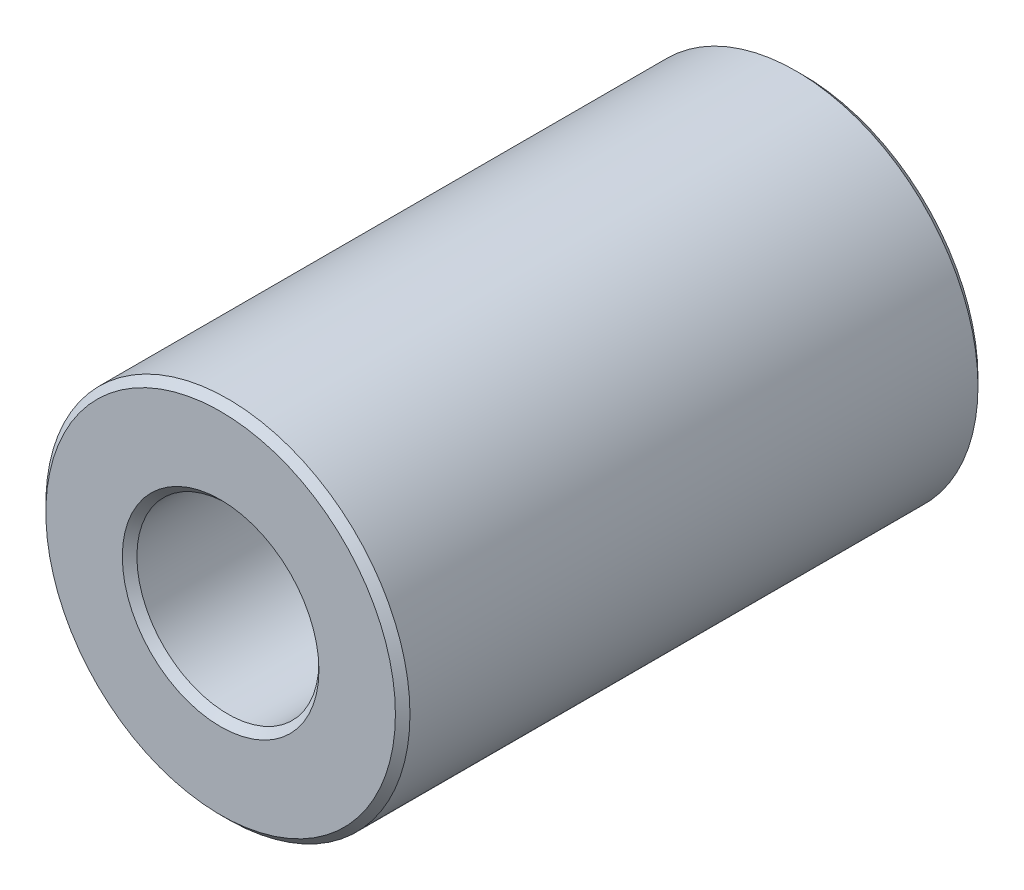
from build123d import *

# Parameters (mm, degrees)
SKETCH1_R           = 2.5
SKETCH1_R_2         = 1.25
BOSS_EXTRUDE2_DEPTH = 4
CHAMFER3_SIZE       = 0.1


with BuildPart() as part:
    # Sketch1 → Boss-Extrude2 (new, symmetric)
    with BuildSketch(Plane.XY):
        Circle(SKETCH1_R)
        Circle(SKETCH1_R_2, mode=Mode.SUBTRACT)
    extrude(amount=BOSS_EXTRUDE2_DEPTH, both=True)

    # Chamfer3
    chamfer3_edges = [part.edges().sort_by_distance(p)[0] for p in [
        (-2.5, 0, -4),
        (-2.5, 0, 4),
        (-1.25, 0, -4),
        (-1.25, 0, 4),
    ]]
    chamfer(chamfer3_edges, length=CHAMFER3_SIZE)


solid = part.part
